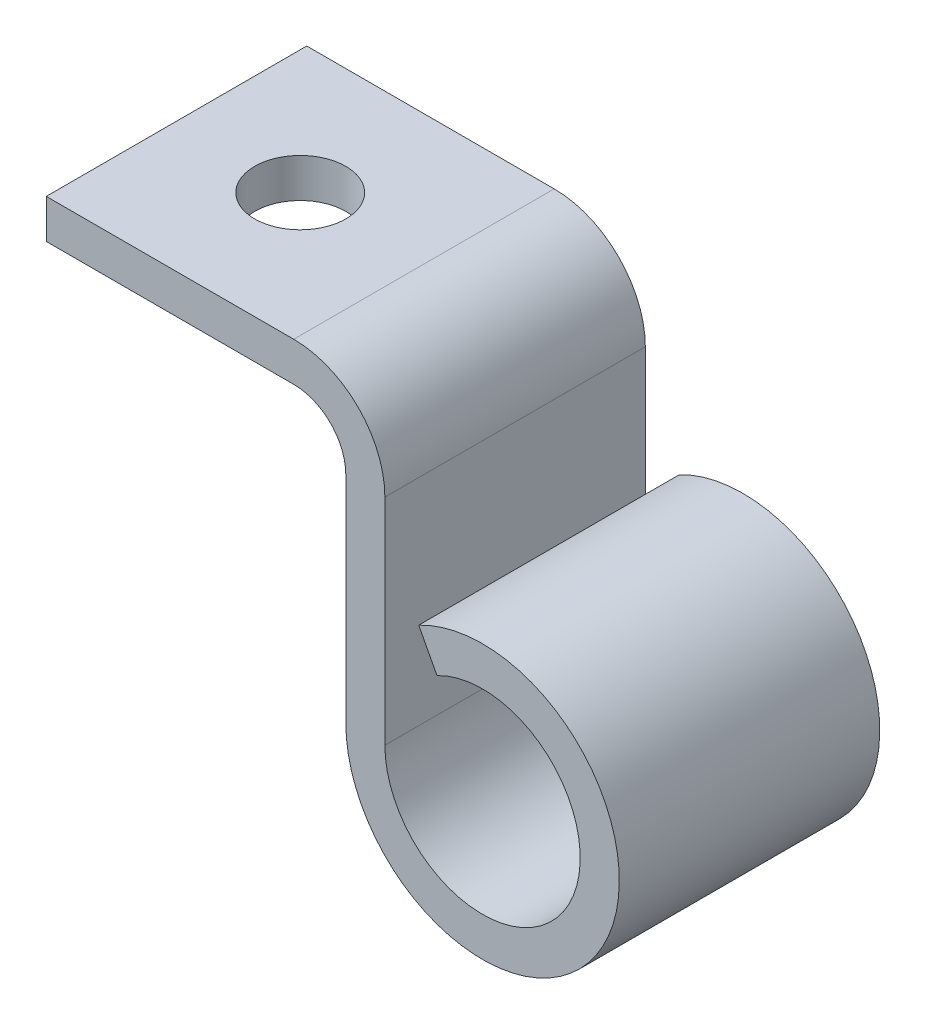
from build123d import *

# Parameters (mm, degrees)
EXTRUDE_THIN1_DEPTH = 10
SKETCH2_R           = 3.5
CUT_EXTRUDE1_DEPTH  = 49.767304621


with BuildPart() as part:
    # Sketch1 → Extrude-Thin1 (new, symmetric)
    with BuildSketch(Plane.XY):
        with BuildLine():
            ThreePointArc((-3.5, 6.633249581), (6.422616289, -3.872983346), (-7.5, 0))
            Line((-7.5, 0), (-7.5, 16.5))
            ThreePointArc((-7.5, 16.5), (-9.550252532, 21.449747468), (-14.5, 23.5))
            Line((-14.5, 23.5), (-33.5, 23.5))
            Line((-33.5, 23.5), (-33.5, 20.5))
            Line((-33.5, 20.5), (-14.5, 20.5))
            ThreePointArc((-14.5, 20.5), (-11.671572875, 19.328427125), (-10.5, 16.5))
            Line((-10.5, 16.5), (-10.5, 0))
            ThreePointArc((-10.5, 0), (8.991662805, -5.422176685), (-4.9, 9.286549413))
            Line((-4.9, 9.286549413), (-3.5, 6.633249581))
        make_face()
    extrude(amount=EXTRUDE_THIN1_DEPTH, both=True)

    # Sketch2 → Cut-Extrude1 (cut, through all)
    with BuildSketch(Plane(origin=(0, 23.5, 0), x_dir=(1, 0, 0), z_dir=(0, 1, 0))):
        with Locations(Location((-24, 0, 0), (0, 0, 180))):
            Circle(SKETCH2_R)
    extrude(amount=-CUT_EXTRUDE1_DEPTH, mode=Mode.SUBTRACT)


solid = part.part
